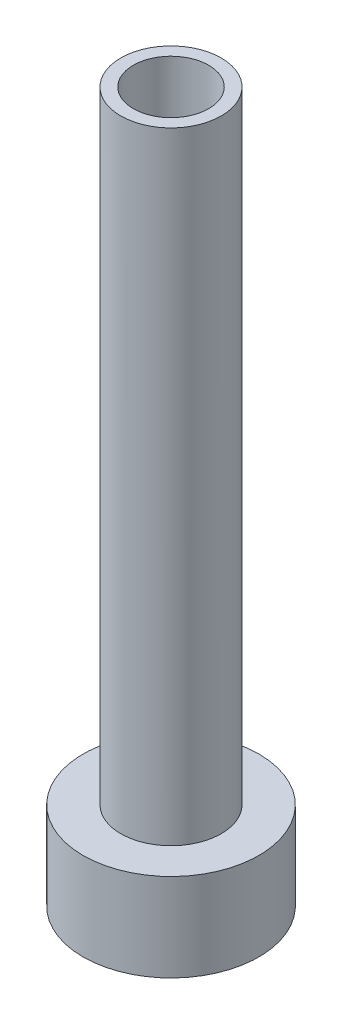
from build123d import *

# Parameters (mm, degrees)
ESQUISSE2_R             = 3.25
ENL_V_MAT_EXTRU_1_DEPTH = 29
CHANFREIN1_SIZE         = 1
ENL_V_START             = -18.5
ESQUISSE4_R             = 4
ENL_V_MAT_EXTRU_2_DEPTH = 18.5


with BuildPart() as part:
    # Esquisse1 → R_volution1 (revolve)
    with BuildSketch(Plane.XY, mode=Mode.PRIVATE) as r_volution1_sk:
        Polygon((-3, 0), (-7, 0), (-7, 7), (-4, 7), (-4, 75), (-3, 75), align=None)
    revolve(r_volution1_sk.sketch.rotate(Axis((0, 0, 0), (0, 1, 0)), 270), axis=Axis((0, 0, 0), (0, 1, 0)))

    # Esquisse2 → Enl_v. mat.-Extru.1 (cut)
    with BuildSketch(Plane(origin=(0, 0, 0), x_dir=(1, 0, 0), z_dir=(0, 1, 0))):
        with Locations(Location((0, 0, 0), (0, 0, 90))):
            Circle(ESQUISSE2_R)
    extrude(amount=ENL_V_MAT_EXTRU_1_DEPTH, mode=Mode.SUBTRACT)

    # Chanfrein1
    chanfrein1_edges = [part.edges().sort_by_distance(p)[0] for p in [
        (0, 0, 3.25),
    ]]
    chamfer(chanfrein1_edges, length=CHANFREIN1_SIZE)

    # Esquisse4 → Enl_v. mat.-Extru.2 (cut)
    with BuildSketch(Plane(origin=(0, 75, 0), x_dir=(1, 0, 0), z_dir=(0, 1, 0)).offset(ENL_V_START)):
        with Locations(Location((0, 0, 0), (0, 0, 90))):
            Circle(ESQUISSE4_R)
    extrude(amount=ENL_V_MAT_EXTRU_2_DEPTH, mode=Mode.SUBTRACT)


solid = part.part
